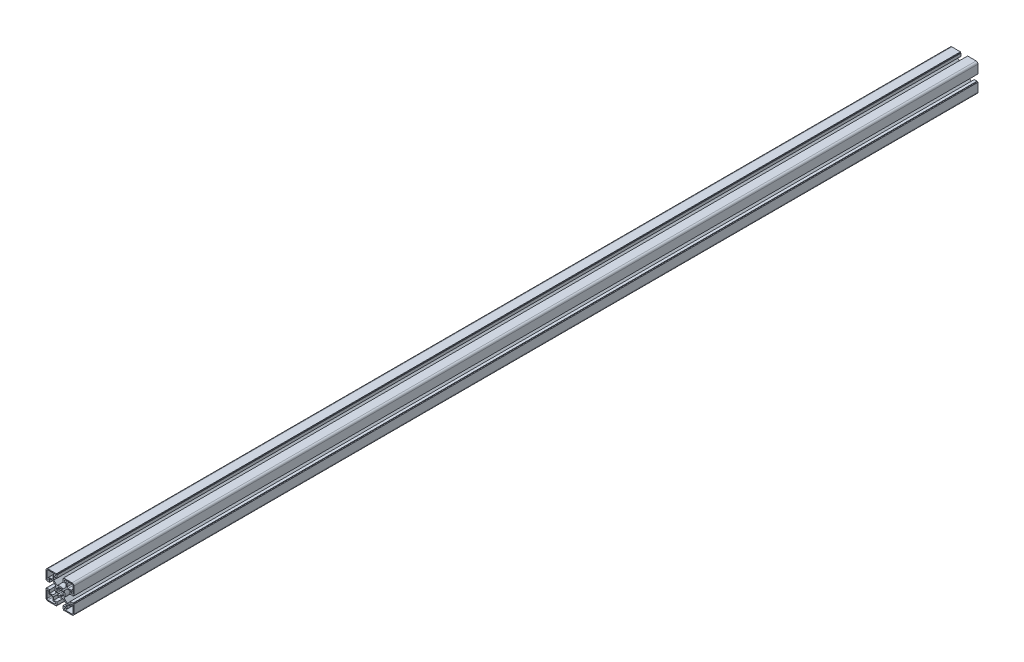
from build123d import *

# Parameters (mm, degrees)
BOSS_EXTRUDE1_DEPTH = 1455.801


with BuildPart() as part:
    # Sketch1 → Boss-Extrude1 (new body)
    with BuildSketch(Plane.XY):
        with BuildLine():
            Line((-19.5072, 22.5044), (-5.7912, 22.5044))
            Line((-5.7912, 22.5044), (-5.7912, 21.0058))
            Line((-5.7912, 21.0058), (-5.0038, 21.0058))
            Line((-5.0038, 21.0058), (-5.0038, 16.51))
            Line((-5.0038, 16.51), (-10.0457, 16.51))
            Line((-10.0457, 16.51), (-10.0457, 11.680106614))
            Line((-10.0457, 11.680106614), (-4.781026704, 6.415433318))
            ThreePointArc((-4.781026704, 6.415433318), (0, 8.001), (4.781026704, 6.415433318))
            Line((4.781026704, 6.415433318), (10.0457, 11.680106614))
            Line((10.0457, 11.680106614), (10.0457, 16.51))
            Line((10.0457, 16.51), (5.0038, 16.51))
            Line((5.0038, 16.51), (5.0038, 21.0058))
            Line((5.0038, 21.0058), (5.7912, 21.0058))
            Line((5.7912, 21.0058), (5.7912, 22.5044))
            Line((5.7912, 22.5044), (19.5072, 22.5044))
            ThreePointArc((19.5072, 22.5044), (21.626540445, 21.626540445), (22.5044, 19.5072))
            Line((22.5044, 19.5072), (22.5044, 5.7912))
            Line((22.5044, 5.7912), (21.0058, 5.7912))
            Line((21.0058, 5.7912), (21.0058, 5.0038))
            Line((21.0058, 5.0038), (16.51, 5.0038))
            Line((16.51, 5.0038), (16.51, 10.0457))
            Line((16.51, 10.0457), (11.680106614, 10.0457))
            Line((11.680106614, 10.0457), (6.415433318, 4.781026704))
            ThreePointArc((6.415433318, 4.781026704), (8.001, 0), (6.415433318, -4.781026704))
            Line((6.415433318, -4.781026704), (11.680106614, -10.0457))
            Line((11.680106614, -10.0457), (16.51, -10.0457))
            Line((16.51, -10.0457), (16.51, -5.0038))
            Line((16.51, -5.0038), (21.0058, -5.0038))
            Line((21.0058, -5.0038), (21.0058, -5.7912))
            Line((21.0058, -5.7912), (22.5044, -5.7912))
            Line((22.5044, -5.7912), (22.5044, -19.5072))
            ThreePointArc((22.5044, -19.5072), (21.626540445, -21.626540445), (19.5072, -22.5044))
            Line((19.5072, -22.5044), (5.7912, -22.5044))
            Line((5.7912, -22.5044), (5.7912, -21.0058))
            Line((5.7912, -21.0058), (5.0038, -21.0058))
            Line((5.0038, -21.0058), (5.0038, -16.51))
            Line((5.0038, -16.51), (10.0457, -16.51))
            Line((10.0457, -16.51), (10.0457, -11.680106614))
            Line((10.0457, -11.680106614), (4.781026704, -6.415433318))
            ThreePointArc((4.781026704, -6.415433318), (0, -8.001), (-4.781026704, -6.415433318))
            Line((-4.781026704, -6.415433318), (-10.0457, -11.680106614))
            Line((-10.0457, -11.680106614), (-10.0457, -16.51))
            Line((-10.0457, -16.51), (-5.0038, -16.51))
            Line((-5.0038, -16.51), (-5.0038, -21.0058))
            Line((-5.0038, -21.0058), (-5.7912, -21.0058))
            Line((-5.7912, -21.0058), (-5.7912, -22.5044))
            Line((-5.7912, -22.5044), (-19.5072, -22.5044))
            ThreePointArc((-19.5072, -22.5044), (-21.626540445, -21.626540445), (-22.5044, -19.5072))
            Line((-22.5044, -19.5072), (-22.5044, -5.7912))
            Line((-22.5044, -5.7912), (-21.0058, -5.7912))
            Line((-21.0058, -5.7912), (-21.0058, -5.0038))
            Line((-21.0058, -5.0038), (-16.51, -5.0038))
            Line((-16.51, -5.0038), (-16.51, -10.0457))
            Line((-16.51, -10.0457), (-11.680106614, -10.0457))
            Line((-11.680106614, -10.0457), (-6.415433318, -4.781026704))
            ThreePointArc((-6.415433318, -4.781026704), (-8.001, 0), (-6.415433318, 4.781026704))
            Line((-6.415433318, 4.781026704), (-11.680106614, 10.0457))
            Line((-11.680106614, 10.0457), (-16.51, 10.0457))
            Line((-16.51, 10.0457), (-16.51, 5.0038))
            Line((-16.51, 5.0038), (-21.0058, 5.0038))
            Line((-21.0058, 5.0038), (-21.0058, 5.7912))
            Line((-21.0058, 5.7912), (-22.5044, 5.7912))
            Line((-22.5044, 5.7912), (-22.5044, 19.5072))
            ThreePointArc((-22.5044, 19.5072), (-21.626540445, 21.626540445), (-19.5072, 22.5044))
        make_face()
        with BuildLine():
            Line((-18.0086, 11.5443), (-13.0429, 11.5443))
            ThreePointArc((-13.0429, 11.5443), (-11.983229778, 11.983229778), (-11.5443, 13.0429))
            Line((-11.5443, 13.0429), (-11.5443, 18.0086))
            Line((-11.5443, 18.0086), (-8.7884, 18.0086))
            ThreePointArc((-8.7884, 18.0086), (-7.2898, 19.5072), (-8.7884, 21.0058))
            Line((-8.7884, 21.0058), (-19.5072, 21.0058))
            ThreePointArc((-19.5072, 21.0058), (-20.566870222, 20.566870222), (-21.0058, 19.5072))
            Line((-21.0058, 19.5072), (-21.0058, 8.7884))
            ThreePointArc((-21.0058, 8.7884), (-19.5072, 7.2898), (-18.0086, 8.7884))
            Line((-18.0086, 8.7884), (-18.0086, 11.5443))
        make_face(mode=Mode.SUBTRACT)
        with BuildLine():
            Line((1.189270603, 5.978867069), (0.976192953, 4.907653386))
            ThreePointArc((0.976192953, 4.907653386), (0, 5.0038), (-0.976192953, 4.907653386))
            Line((-0.976192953, 4.907653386), (-1.189270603, 5.978867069))
            ThreePointArc((-1.189270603, 5.978867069), (-2.332838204, 5.63196963), (-3.38675614, 5.068638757))
            Line((-3.38675614, 5.068638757), (-2.779962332, 4.160507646))
            ThreePointArc((-2.779962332, 4.160507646), (-3.538220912, 3.538220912), (-4.160507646, 2.779962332))
            Line((-4.160507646, 2.779962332), (-5.068638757, 3.38675614))
            ThreePointArc((-5.068638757, 3.38675614), (-5.63196963, 2.332838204), (-5.978867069, 1.189270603))
            Line((-5.978867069, 1.189270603), (-4.907653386, 0.976192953))
            ThreePointArc((-4.907653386, 0.976192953), (-5.0038, 0), (-4.907653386, -0.976192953))
            Line((-4.907653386, -0.976192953), (-5.978867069, -1.189270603))
            ThreePointArc((-5.978867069, -1.189270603), (-5.63196963, -2.332838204), (-5.068638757, -3.38675614))
            Line((-5.068638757, -3.38675614), (-4.160507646, -2.779962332))
            ThreePointArc((-4.160507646, -2.779962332), (-3.538220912, -3.538220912), (-2.779962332, -4.160507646))
            Line((-2.779962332, -4.160507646), (-3.38675614, -5.068638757))
            ThreePointArc((-3.38675614, -5.068638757), (-2.332838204, -5.63196963), (-1.189270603, -5.978867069))
            Line((-1.189270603, -5.978867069), (-0.976192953, -4.907653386))
            ThreePointArc((-0.976192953, -4.907653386), (0, -5.0038), (0.976192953, -4.907653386))
            Line((0.976192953, -4.907653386), (1.189270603, -5.978867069))
            ThreePointArc((1.189270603, -5.978867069), (2.332838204, -5.63196963), (3.38675614, -5.068638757))
            Line((3.38675614, -5.068638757), (2.779962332, -4.160507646))
            ThreePointArc((2.779962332, -4.160507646), (3.538220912, -3.538220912), (4.160507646, -2.779962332))
            Line((4.160507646, -2.779962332), (5.068638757, -3.38675614))
            ThreePointArc((5.068638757, -3.38675614), (5.63196963, -2.332838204), (5.978867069, -1.189270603))
            Line((5.978867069, -1.189270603), (4.907653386, -0.976192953))
            ThreePointArc((4.907653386, -0.976192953), (5.0038, 0), (4.907653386, 0.976192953))
            Line((4.907653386, 0.976192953), (5.978867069, 1.189270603))
            ThreePointArc((5.978867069, 1.189270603), (5.63196963, 2.332838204), (5.068638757, 3.38675614))
            Line((5.068638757, 3.38675614), (4.160507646, 2.779962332))
            ThreePointArc((4.160507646, 2.779962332), (3.538220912, 3.538220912), (2.779962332, 4.160507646))
            Line((2.779962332, 4.160507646), (3.38675614, 5.068638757))
            ThreePointArc((3.38675614, 5.068638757), (2.332838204, 5.63196963), (1.189270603, 5.978867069))
        make_face(mode=Mode.SUBTRACT)
        with BuildLine():
            Line((11.5443, 18.0086), (8.7884, 18.0086))
            ThreePointArc((8.7884, 18.0086), (7.2898, 19.5072), (8.7884, 21.0058))
            Line((8.7884, 21.0058), (19.5072, 21.0058))
            ThreePointArc((19.5072, 21.0058), (20.566870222, 20.566870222), (21.0058, 19.5072))
            Line((21.0058, 19.5072), (21.0058, 8.7884))
            ThreePointArc((21.0058, 8.7884), (19.5072, 7.2898), (18.0086, 8.7884))
            Line((18.0086, 8.7884), (18.0086, 11.5443))
            Line((18.0086, 11.5443), (13.0429, 11.5443))
            ThreePointArc((13.0429, 11.5443), (11.983229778, 11.983229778), (11.5443, 13.0429))
            Line((11.5443, 13.0429), (11.5443, 18.0086))
        make_face(mode=Mode.SUBTRACT)
        with BuildLine():
            Line((18.0086, -11.5443), (13.0429, -11.5443))
            ThreePointArc((13.0429, -11.5443), (11.983229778, -11.983229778), (11.5443, -13.0429))
            Line((11.5443, -13.0429), (11.5443, -18.0086))
            Line((11.5443, -18.0086), (8.7884, -18.0086))
            ThreePointArc((8.7884, -18.0086), (7.2898, -19.5072), (8.7884, -21.0058))
            Line((8.7884, -21.0058), (19.5072, -21.0058))
            ThreePointArc((19.5072, -21.0058), (20.566870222, -20.566870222), (21.0058, -19.5072))
            Line((21.0058, -19.5072), (21.0058, -8.7884))
            ThreePointArc((21.0058, -8.7884), (19.5072, -7.2898), (18.0086, -8.7884))
            Line((18.0086, -8.7884), (18.0086, -11.5443))
        make_face(mode=Mode.SUBTRACT)
        with BuildLine():
            Line((-11.5443, -18.0086), (-8.7884, -18.0086))
            ThreePointArc((-8.7884, -18.0086), (-7.2898, -19.5072), (-8.7884, -21.0058))
            Line((-8.7884, -21.0058), (-19.5072, -21.0058))
            ThreePointArc((-19.5072, -21.0058), (-20.566870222, -20.566870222), (-21.0058, -19.5072))
            Line((-21.0058, -19.5072), (-21.0058, -8.7884))
            ThreePointArc((-21.0058, -8.7884), (-19.5072, -7.2898), (-18.0086, -8.7884))
            Line((-18.0086, -8.7884), (-18.0086, -11.5443))
            Line((-18.0086, -11.5443), (-13.0429, -11.5443))
            ThreePointArc((-13.0429, -11.5443), (-11.983229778, -11.983229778), (-11.5443, -13.0429))
            Line((-11.5443, -13.0429), (-11.5443, -18.0086))
        make_face(mode=Mode.SUBTRACT)
    extrude(amount=BOSS_EXTRUDE1_DEPTH)


solid = part.part
